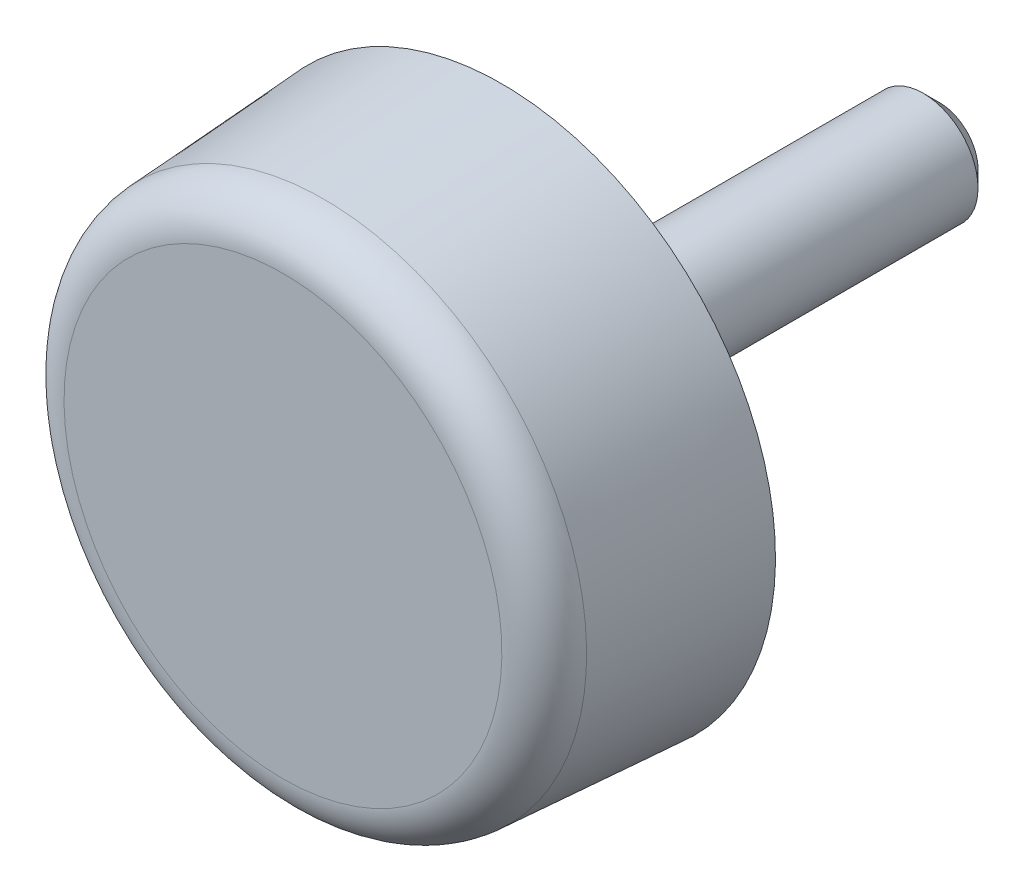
ISO-10303-21;
HEADER;
FILE_DESCRIPTION(('STEP AP214'),'2;1');
FILE_NAME('part.step','',(''),(''),'','','');
FILE_SCHEMA(('AUTOMOTIVE_DESIGN { 1 0 10303 214 1 1 1 1 }'));
ENDSEC;
DATA;
#1=APPLICATION_CONTEXT('core data for automotive mechanical design processes');
#2=APPLICATION_PROTOCOL_DEFINITION('international standard','automotive_design',2000,#1);
#3=PRODUCT_CONTEXT('',#1,'mechanical');
#4=PRODUCT('Part','Part','',(#3));
#5=PRODUCT_RELATED_PRODUCT_CATEGORY('part','',(#4));
#6=PRODUCT_DEFINITION_FORMATION('','',#4);
#7=PRODUCT_DEFINITION_CONTEXT('part definition',#1,'design');
#8=PRODUCT_DEFINITION('design','',#6,#7);
#9=PRODUCT_DEFINITION_SHAPE('','',#8);
#10=(LENGTH_UNIT() NAMED_UNIT(*) SI_UNIT(.MILLI.,.METRE.));
#11=(NAMED_UNIT(*) PLANE_ANGLE_UNIT() SI_UNIT($,.RADIAN.));
#12=(NAMED_UNIT(*) SI_UNIT($,.STERADIAN.) SOLID_ANGLE_UNIT());
#13=UNCERTAINTY_MEASURE_WITH_UNIT(LENGTH_MEASURE(1.E-05),#10,'distance_accuracy_value','');
#14=(GEOMETRIC_REPRESENTATION_CONTEXT(3) GLOBAL_UNCERTAINTY_ASSIGNED_CONTEXT((#13)) GLOBAL_UNIT_ASSIGNED_CONTEXT((#10,
#11,#12)) REPRESENTATION_CONTEXT('',''));
#15=CARTESIAN_POINT('',(0.,0.,0.));
#16=DIRECTION('',(0.,0.,1.));
#17=DIRECTION('',(1.,0.,0.));
#18=AXIS2_PLACEMENT_3D('',#15,#16,#17);
#19=CARTESIAN_POINT('',(0.,0.,20.));
#20=DIRECTION('',(0.,0.,1.));
#21=DIRECTION('',(0.,-1.,0.));
#22=AXIS2_PLACEMENT_3D('',#19,#20,#21);
#23=CYLINDRICAL_SURFACE('',#22,22.5);
#24=CARTESIAN_POINT('',(0.,0.,0.));
#25=DIRECTION('',(0.,0.,1.));
#26=DIRECTION('',(0.,-1.,0.));
#27=AXIS2_PLACEMENT_3D('',#24,#25,#26);
#28=CIRCLE('',#27,22.5);
#29=CARTESIAN_POINT('',(0.,-22.5,0.));
#30=VERTEX_POINT('',#29);
#31=EDGE_CURVE('E27',#30,#30,#28,.T.);
#32=ORIENTED_EDGE('',*,*,#31,.F.);
#33=EDGE_LOOP('',(#32));
#34=FACE_BOUND('',#33,.T.);
#35=CARTESIAN_POINT('',(0.,0.,0.0500000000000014));
#36=DIRECTION('',(0.,0.,1.));
#37=DIRECTION('',(0.,-1.,0.));
#38=AXIS2_PLACEMENT_3D('',#35,#36,#37);
#39=CIRCLE('',#38,22.5);
#40=CARTESIAN_POINT('',(0.,-22.5,0.0500000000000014));
#41=VERTEX_POINT('',#40);
#42=EDGE_CURVE('E44',#41,#41,#39,.T.);
#43=ORIENTED_EDGE('',*,*,#42,.T.);
#44=EDGE_LOOP('',(#43));
#45=FACE_BOUND('',#44,.T.);
#46=ADVANCED_FACE('F12',(#34,#45),#23,.F.);
#47=CARTESIAN_POINT('',(22.5,0.,0.));
#48=DIRECTION('',(0.,0.,1.));
#49=DIRECTION('',(0.,-1.,0.));
#50=AXIS2_PLACEMENT_3D('',#47,#48,#49);
#51=PLANE('',#50);
#52=CARTESIAN_POINT('',(0.,0.,0.));
#53=DIRECTION('',(0.,0.,1.));
#54=DIRECTION('',(0.,-1.,0.));
#55=AXIS2_PLACEMENT_3D('',#52,#53,#54);
#56=CIRCLE('',#55,25.);
#57=CARTESIAN_POINT('',(0.,-25.,0.));
#58=VERTEX_POINT('',#57);
#59=EDGE_CURVE('E32',#58,#58,#56,.T.);
#60=ORIENTED_EDGE('',*,*,#59,.F.);
#61=EDGE_LOOP('',(#60));
#62=FACE_BOUND('',#61,.T.);
#63=ORIENTED_EDGE('',*,*,#31,.T.);
#64=EDGE_LOOP('',(#63));
#65=FACE_BOUND('',#64,.T.);
#66=ADVANCED_FACE('F72',(#62,#65),#51,.F.);
#67=CARTESIAN_POINT('',(0.,0.,0.));
#68=DIRECTION('',(0.,0.,-1.));
#69=DIRECTION('',(0.,1.,0.));
#70=AXIS2_PLACEMENT_3D('',#67,#68,#69);
#71=CONICAL_SURFACE('',#70,25.,0.0619403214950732);
#72=CARTESIAN_POINT('',(0.,0.,16.2476028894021));
#73=DIRECTION('',(0.,0.,1.));
#74=DIRECTION('',(0.,-1.,0.));
#75=AXIS2_PLACEMENT_3D('',#72,#73,#74);
#76=CIRCLE('',#75,23.9923292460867);
#77=CARTESIAN_POINT('',(0.,-23.9923292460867,16.2476028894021));
#78=VERTEX_POINT('',#77);
#79=EDGE_CURVE('E35',#78,#78,#76,.T.);
#80=ORIENTED_EDGE('',*,*,#79,.F.);
#81=EDGE_LOOP('',(#80));
#82=FACE_BOUND('',#81,.T.);
#83=ORIENTED_EDGE('',*,*,#59,.T.);
#84=EDGE_LOOP('',(#83));
#85=FACE_BOUND('',#84,.T.);
#86=ADVANCED_FACE('F77',(#82,#85),#71,.T.);
#87=CARTESIAN_POINT('',(0.,0.,16.));
#88=DIRECTION('',(0.,0.,1.));
#89=DIRECTION('',(0.,-1.,0.));
#90=AXIS2_PLACEMENT_3D('',#87,#88,#89);
#91=TOROIDAL_SURFACE('',#90,20.,4.);
#92=ORIENTED_EDGE('',*,*,#79,.T.);
#93=EDGE_LOOP('',(#92));
#94=FACE_BOUND('',#93,.T.);
#95=CARTESIAN_POINT('',(0.,0.,20.));
#96=DIRECTION('',(0.,0.,1.));
#97=DIRECTION('',(0.,-1.,0.));
#98=AXIS2_PLACEMENT_3D('',#95,#96,#97);
#99=CIRCLE('',#98,20.);
#100=CARTESIAN_POINT('',(0.,-20.,20.));
#101=VERTEX_POINT('',#100);
#102=EDGE_CURVE('E38',#101,#101,#99,.T.);
#103=ORIENTED_EDGE('',*,*,#102,.F.);
#104=EDGE_LOOP('',(#103));
#105=FACE_BOUND('',#104,.T.);
#106=ADVANCED_FACE('F84',(#94,#105),#91,.T.);
#107=CARTESIAN_POINT('',(20.,0.,20.));
#108=DIRECTION('',(0.,0.,-1.));
#109=DIRECTION('',(0.,1.,0.));
#110=AXIS2_PLACEMENT_3D('',#107,#108,#109);
#111=PLANE('',#110);
#112=ORIENTED_EDGE('',*,*,#102,.T.);
#113=EDGE_LOOP('',(#112));
#114=FACE_BOUND('',#113,.T.);
#115=ADVANCED_FACE('F59',(#114),#111,.F.);
#116=CARTESIAN_POINT('',(0.,0.,0.));
#117=DIRECTION('',(0.,0.,1.));
#118=DIRECTION('',(0.,-1.,0.));
#119=AXIS2_PLACEMENT_3D('',#116,#117,#118);
#120=PLANE('',#119);
#121=CARTESIAN_POINT('',(0.,0.,0.));
#122=DIRECTION('',(0.,0.,1.));
#123=DIRECTION('',(0.,-1.,0.));
#124=AXIS2_PLACEMENT_3D('',#121,#122,#123);
#125=CIRCLE('',#124,22.45);
#126=CARTESIAN_POINT('',(0.,-22.45,0.));
#127=VERTEX_POINT('',#126);
#128=EDGE_CURVE('E41',#127,#127,#125,.T.);
#129=ORIENTED_EDGE('',*,*,#128,.F.);
#130=EDGE_LOOP('',(#129));
#131=FACE_BOUND('',#130,.T.);
#132=CARTESIAN_POINT('',(0.,0.,0.));
#133=DIRECTION('',(0.,0.,1.));
#134=DIRECTION('',(0.,-1.,0.));
#135=AXIS2_PLACEMENT_3D('',#132,#133,#134);
#136=CIRCLE('',#135,5.);
#137=CARTESIAN_POINT('',(0.,-5.,0.));
#138=VERTEX_POINT('',#137);
#139=EDGE_CURVE('E23',#138,#138,#136,.T.);
#140=ORIENTED_EDGE('',*,*,#139,.T.);
#141=EDGE_LOOP('',(#140));
#142=FACE_BOUND('',#141,.T.);
#143=ADVANCED_FACE('F53',(#131,#142),#120,.F.);
#144=CARTESIAN_POINT('',(0.,0.,0.));
#145=DIRECTION('',(0.,0.,1.));
#146=DIRECTION('',(0.,-1.,0.));
#147=AXIS2_PLACEMENT_3D('',#144,#145,#146);
#148=CONICAL_SURFACE('',#147,22.45,0.785398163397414);
#149=ORIENTED_EDGE('',*,*,#42,.F.);
#150=EDGE_LOOP('',(#149));
#151=FACE_BOUND('',#150,.T.);
#152=ORIENTED_EDGE('',*,*,#128,.T.);
#153=EDGE_LOOP('',(#152));
#154=FACE_BOUND('',#153,.T.);
#155=ADVANCED_FACE('F49',(#151,#154),#148,.T.);
#156=CARTESIAN_POINT('',(0.,0.,20.));
#157=DIRECTION('',(0.,0.,1.));
#158=DIRECTION('',(0.,-1.,0.));
#159=AXIS2_PLACEMENT_3D('',#156,#157,#158);
#160=CYLINDRICAL_SURFACE('',#159,5.);
#161=CARTESIAN_POINT('',(0.,0.,-38.5));
#162=DIRECTION('',(0.,0.,-1.));
#163=DIRECTION('',(0.,1.,0.));
#164=AXIS2_PLACEMENT_3D('',#161,#162,#163);
#165=CIRCLE('',#164,5.);
#166=CARTESIAN_POINT('',(0.,5.,-38.5));
#167=VERTEX_POINT('',#166);
#168=EDGE_CURVE('E8',#167,#167,#165,.F.);
#169=ORIENTED_EDGE('',*,*,#168,.T.);
#170=EDGE_LOOP('',(#169));
#171=FACE_BOUND('',#170,.T.);
#172=ORIENTED_EDGE('',*,*,#139,.F.);
#173=EDGE_LOOP('',(#172));
#174=FACE_BOUND('',#173,.T.);
#175=ADVANCED_FACE('F52',(#171,#174),#160,.T.);
#176=CARTESIAN_POINT('',(0.,0.,-40.));
#177=DIRECTION('',(0.,0.,-1.));
#178=DIRECTION('',(0.,1.,0.));
#179=AXIS2_PLACEMENT_3D('',#176,#177,#178);
#180=PLANE('',#179);
#181=CARTESIAN_POINT('',(0.,0.,-40.));
#182=DIRECTION('',(0.,0.,-1.));
#183=DIRECTION('',(0.,1.,0.));
#184=AXIS2_PLACEMENT_3D('',#181,#182,#183);
#185=CIRCLE('',#184,3.5);
#186=CARTESIAN_POINT('',(0.,3.5,-40.));
#187=VERTEX_POINT('',#186);
#188=EDGE_CURVE('E19',#187,#187,#185,.T.);
#189=ORIENTED_EDGE('',*,*,#188,.T.);
#190=EDGE_LOOP('',(#189));
#191=FACE_BOUND('',#190,.T.);
#192=ADVANCED_FACE('F64',(#191),#180,.T.);
#193=CARTESIAN_POINT('',(0.,0.,-40.));
#194=DIRECTION('',(0.,0.,1.));
#195=DIRECTION('',(0.,-1.,0.));
#196=AXIS2_PLACEMENT_3D('',#193,#194,#195);
#197=CONICAL_SURFACE('',#196,3.5,0.785398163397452);
#198=ORIENTED_EDGE('',*,*,#168,.F.);
#199=EDGE_LOOP('',(#198));
#200=FACE_BOUND('',#199,.T.);
#201=ORIENTED_EDGE('',*,*,#188,.F.);
#202=EDGE_LOOP('',(#201));
#203=FACE_BOUND('',#202,.T.);
#204=ADVANCED_FACE('F14',(#200,#203),#197,.T.);
#205=CLOSED_SHELL('',(#46,#66,#86,#106,#115,#143,#155,#175,#192,#204));
#206=MANIFOLD_SOLID_BREP('B1',#205);
#207=ADVANCED_BREP_SHAPE_REPRESENTATION('',(#18,#206),#14);
#208=SHAPE_DEFINITION_REPRESENTATION(#9,#207);
ENDSEC;
END-ISO-10303-21;
